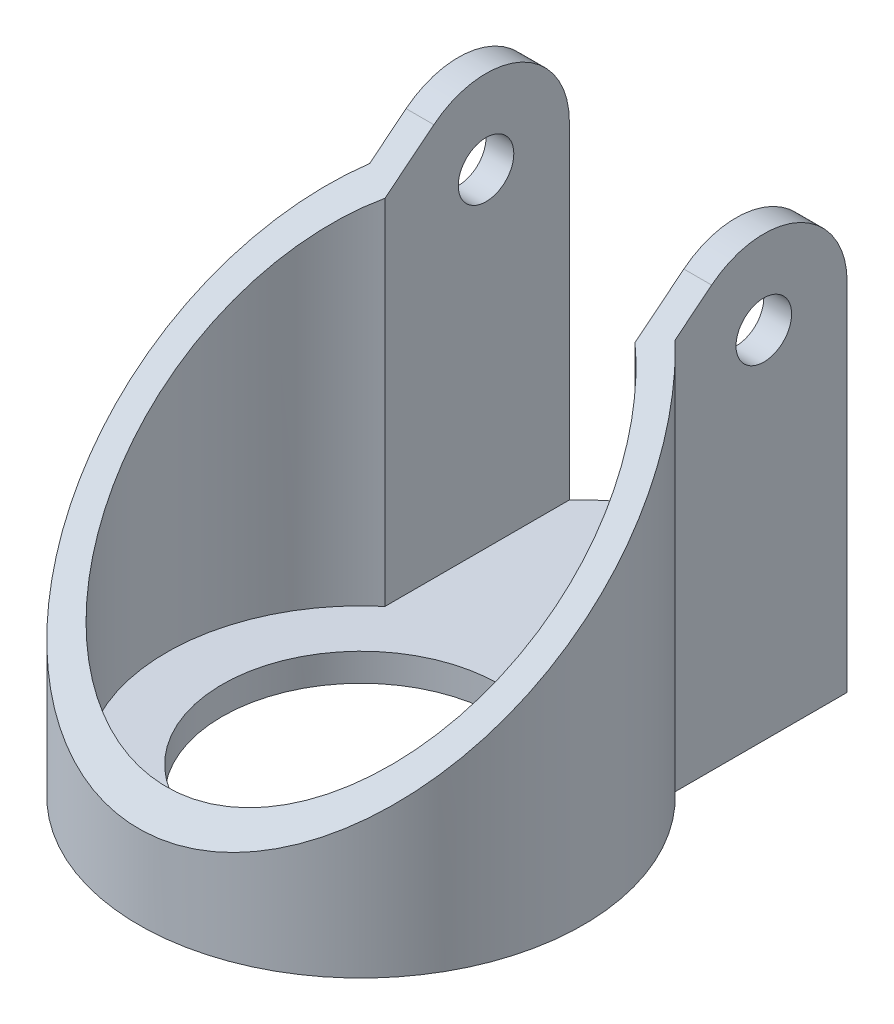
ISO-10303-21;
HEADER;
FILE_DESCRIPTION(('STEP AP214'),'2;1');
FILE_NAME('part.step','',(''),(''),'','','');
FILE_SCHEMA(('AUTOMOTIVE_DESIGN { 1 0 10303 214 1 1 1 1 }'));
ENDSEC;
DATA;
#1=APPLICATION_CONTEXT('core data for automotive mechanical design processes');
#2=APPLICATION_PROTOCOL_DEFINITION('international standard','automotive_design',2000,#1);
#3=PRODUCT_CONTEXT('',#1,'mechanical');
#4=PRODUCT('Part','Part','',(#3));
#5=PRODUCT_RELATED_PRODUCT_CATEGORY('part','',(#4));
#6=PRODUCT_DEFINITION_FORMATION('','',#4);
#7=PRODUCT_DEFINITION_CONTEXT('part definition',#1,'design');
#8=PRODUCT_DEFINITION('design','',#6,#7);
#9=PRODUCT_DEFINITION_SHAPE('','',#8);
#10=(LENGTH_UNIT() NAMED_UNIT(*) SI_UNIT(.MILLI.,.METRE.));
#11=(NAMED_UNIT(*) PLANE_ANGLE_UNIT() SI_UNIT($,.RADIAN.));
#12=(NAMED_UNIT(*) SI_UNIT($,.STERADIAN.) SOLID_ANGLE_UNIT());
#13=UNCERTAINTY_MEASURE_WITH_UNIT(LENGTH_MEASURE(1.E-05),#10,'distance_accuracy_value','');
#14=(GEOMETRIC_REPRESENTATION_CONTEXT(3) GLOBAL_UNCERTAINTY_ASSIGNED_CONTEXT((#13)) GLOBAL_UNIT_ASSIGNED_CONTEXT((#10,
#11,#12)) REPRESENTATION_CONTEXT('',''));
#15=CARTESIAN_POINT('',(0.,0.,0.));
#16=DIRECTION('',(0.,0.,1.));
#17=DIRECTION('',(1.,0.,0.));
#18=AXIS2_PLACEMENT_3D('',#15,#16,#17);
#19=CARTESIAN_POINT('',(-27.4999999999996,100.,-60.0000000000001));
#20=DIRECTION('',(0.,0.,1.00000000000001));
#21=DIRECTION('',(1.00000000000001,0.,0.));
#22=AXIS2_PLACEMENT_3D('',#19,#20,#21);
#23=PLANE('',#22);
#24=DIRECTION('',(0.,-1.,0.));
#25=VECTOR('',#24,1.);
#26=CARTESIAN_POINT('',(22.4999999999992,99.9999999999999,-60.0000000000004));
#27=LINE('',#26,#25);
#28=CARTESIAN_POINT('',(22.4999999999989,4.99999999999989,-60.0000000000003));
#29=VERTEX_POINT('',#28);
#30=CARTESIAN_POINT('',(22.4999999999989,-1.11022302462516E-13,-60.0000000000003));
#31=VERTEX_POINT('',#30);
#32=EDGE_CURVE('E245',#29,#31,#27,.T.);
#33=ORIENTED_EDGE('',*,*,#32,.F.);
#34=DIRECTION('',(0.,1.,0.));
#35=VECTOR('',#34,1.);
#36=CARTESIAN_POINT('',(22.4999999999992,99.9999999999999,-60.0000000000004));
#37=LINE('',#36,#35);
#38=CARTESIAN_POINT('',(22.4999999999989,63.9999999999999,-60.0000000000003));
#39=VERTEX_POINT('',#38);
#40=EDGE_CURVE('E168',#29,#39,#37,.T.);
#41=ORIENTED_EDGE('',*,*,#40,.T.);
#42=DIRECTION('',(1.00000000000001,0.,0.));
#43=VECTOR('',#42,1.);
#44=CARTESIAN_POINT('',(-49.9999999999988,63.9999999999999,-60.0000000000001));
#45=LINE('',#44,#43);
#46=CARTESIAN_POINT('',(27.5000000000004,63.9999999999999,-60.0000000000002));
#47=VERTEX_POINT('',#46);
#48=EDGE_CURVE('E179',#39,#47,#45,.T.);
#49=ORIENTED_EDGE('',*,*,#48,.T.);
#50=DIRECTION('',(0.,-1.,0.));
#51=VECTOR('',#50,1.);
#52=CARTESIAN_POINT('',(27.5000000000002,99.9999999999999,-60.));
#53=LINE('',#52,#51);
#54=CARTESIAN_POINT('',(27.5000000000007,-1.11022302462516E-13,-60.0000000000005));
#55=VERTEX_POINT('',#54);
#56=EDGE_CURVE('E248',#47,#55,#53,.T.);
#57=ORIENTED_EDGE('',*,*,#56,.T.);
#58=DIRECTION('',(-1.00000000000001,0.,0.));
#59=VECTOR('',#58,1.);
#60=CARTESIAN_POINT('',(22.4999999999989,-1.11022302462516E-13,-60.0000000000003));
#61=LINE('',#60,#59);
#62=EDGE_CURVE('E220',#55,#31,#61,.T.);
#63=ORIENTED_EDGE('',*,*,#62,.T.);
#64=EDGE_LOOP('',(#33,#41,#49,#57,#63));
#65=FACE_BOUND('',#64,.T.);
#66=ADVANCED_FACE('F39',(#65),#23,.F.);
#67=CARTESIAN_POINT('',(-49.9999999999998,63.9999999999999,-45.));
#68=DIRECTION('',(1.00000000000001,0.,0.));
#69=DIRECTION('',(0.,0.,-1.00000000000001));
#70=AXIS2_PLACEMENT_3D('',#67,#68,#69);
#71=CYLINDRICAL_SURFACE('',#70,5.);
#72=CARTESIAN_POINT('',(22.5000000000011,63.9999999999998,-44.9999999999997));
#73=DIRECTION('',(1.00000000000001,0.,0.));
#74=DIRECTION('',(0.,0.,-1.00000000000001));
#75=AXIS2_PLACEMENT_3D('',#72,#73,#74);
#76=CIRCLE('',#75,5.);
#77=CARTESIAN_POINT('',(22.5000000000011,63.9999999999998,-49.9999999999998));
#78=VERTEX_POINT('',#77);
#79=EDGE_CURVE('E172',#78,#78,#76,.F.);
#80=ORIENTED_EDGE('',*,*,#79,.T.);
#81=EDGE_LOOP('',(#80));
#82=FACE_BOUND('',#81,.T.);
#83=CARTESIAN_POINT('',(27.4999999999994,63.9999999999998,-44.9999999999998));
#84=DIRECTION('',(-1.00000000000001,0.,0.));
#85=DIRECTION('',(0.,0.,1.00000000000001));
#86=AXIS2_PLACEMENT_3D('',#83,#84,#85);
#87=CIRCLE('',#86,5.);
#88=CARTESIAN_POINT('',(27.4999999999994,63.9999999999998,-39.9999999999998));
#89=VERTEX_POINT('',#88);
#90=EDGE_CURVE('E205',#89,#89,#87,.T.);
#91=ORIENTED_EDGE('',*,*,#90,.F.);
#92=EDGE_LOOP('',(#91));
#93=FACE_BOUND('',#92,.T.);
#94=ADVANCED_FACE('F312',(#82,#93),#71,.F.);
#95=CARTESIAN_POINT('',(-49.9999999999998,63.9999999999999,-45.));
#96=DIRECTION('',(1.00000000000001,0.,0.));
#97=DIRECTION('',(0.,0.,-1.00000000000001));
#98=AXIS2_PLACEMENT_3D('',#95,#96,#97);
#99=CYLINDRICAL_SURFACE('',#98,15.);
#100=CARTESIAN_POINT('',(22.5000000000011,63.9999999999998,-44.9999999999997));
#101=DIRECTION('',(1.00000000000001,0.,0.));
#102=DIRECTION('',(0.,0.,-1.00000000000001));
#103=AXIS2_PLACEMENT_3D('',#100,#101,#102);
#104=CIRCLE('',#103,15.);
#105=CARTESIAN_POINT('',(22.5000000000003,75.697217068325,-35.6098395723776));
#106=VERTEX_POINT('',#105);
#107=EDGE_CURVE('E165',#106,#39,#104,.F.);
#108=ORIENTED_EDGE('',*,*,#107,.F.);
#109=DIRECTION('',(1.00000000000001,0.,0.));
#110=VECTOR('',#109,1.);
#111=CARTESIAN_POINT('',(-50.0000000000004,75.697217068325,-35.6098395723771));
#112=LINE('',#111,#110);
#113=CARTESIAN_POINT('',(27.4999999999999,75.697217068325,-35.6098395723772));
#114=VERTEX_POINT('',#113);
#115=EDGE_CURVE('E185',#106,#114,#112,.T.);
#116=ORIENTED_EDGE('',*,*,#115,.T.);
#117=CARTESIAN_POINT('',(27.4999999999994,63.9999999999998,-44.9999999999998));
#118=DIRECTION('',(-1.00000000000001,0.,0.));
#119=DIRECTION('',(0.,0.,1.00000000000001));
#120=AXIS2_PLACEMENT_3D('',#117,#118,#119);
#121=CIRCLE('',#120,15.);
#122=EDGE_CURVE('E198',#114,#47,#121,.T.);
#123=ORIENTED_EDGE('',*,*,#122,.T.);
#124=ORIENTED_EDGE('',*,*,#48,.F.);
#125=EDGE_LOOP('',(#108,#116,#123,#124));
#126=FACE_BOUND('',#125,.T.);
#127=ADVANCED_FACE('F280',(#126),#99,.T.);
#128=CARTESIAN_POINT('',(0.,100.,2.35922392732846E-13));
#129=DIRECTION('',(0.,-1.,0.));
#130=DIRECTION('',(0.,0.,-1.00000000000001));
#131=AXIS2_PLACEMENT_3D('',#128,#129,#130);
#132=CYLINDRICAL_SURFACE('',#131,40.);
#133=CARTESIAN_POINT('',(-9.43689570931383E-13,47.1107503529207,0.));
#134=DIRECTION('',(0.,0.779814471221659,0.626010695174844));
#135=DIRECTION('',(0.,-0.626010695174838,0.779814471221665));
#136=AXIS2_PLACEMENT_3D('',#133,#134,#135);
#137=ELLIPSE('',#136,51.2942519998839,40.);
#138=CARTESIAN_POINT('',(-27.4999999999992,70.4290756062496,-29.0473750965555));
#139=VERTEX_POINT('',#138);
#140=CARTESIAN_POINT('',(27.499999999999,70.4290756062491,-29.0473750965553));
#141=VERTEX_POINT('',#140);
#142=EDGE_CURVE('E191',#139,#141,#137,.T.);
#143=ORIENTED_EDGE('',*,*,#142,.F.);
#144=DIRECTION('',(0.,-1.,0.));
#145=VECTOR('',#144,1.);
#146=CARTESIAN_POINT('',(-27.4999999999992,100.,-29.0473750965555));
#147=LINE('',#146,#145);
#148=CARTESIAN_POINT('',(-27.4999999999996,0.,-29.0473750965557));
#149=VERTEX_POINT('',#148);
#150=EDGE_CURVE('E235',#139,#149,#147,.T.);
#151=ORIENTED_EDGE('',*,*,#150,.T.);
#152=CARTESIAN_POINT('',(0.,0.,0.));
#153=DIRECTION('',(0.,1.,0.));
#154=DIRECTION('',(0.,0.,1.00000000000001));
#155=AXIS2_PLACEMENT_3D('',#152,#153,#154);
#156=CIRCLE('',#155,40.);
#157=CARTESIAN_POINT('',(27.4999999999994,0.,-29.0473750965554));
#158=VERTEX_POINT('',#157);
#159=EDGE_CURVE('E213',#149,#158,#156,.T.);
#160=ORIENTED_EDGE('',*,*,#159,.T.);
#161=DIRECTION('',(0.,-1.,0.));
#162=VECTOR('',#161,1.);
#163=CARTESIAN_POINT('',(27.4999999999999,100.,-29.0473750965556));
#164=LINE('',#163,#162);
#165=EDGE_CURVE('E251',#141,#158,#164,.T.);
#166=ORIENTED_EDGE('',*,*,#165,.F.);
#167=EDGE_LOOP('',(#143,#151,#160,#166));
#168=FACE_BOUND('',#167,.T.);
#169=ADVANCED_FACE('F41',(#168),#132,.T.);
#170=CARTESIAN_POINT('',(27.5000000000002,99.9999999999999,-60.));
#171=DIRECTION('',(-1.00000000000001,0.,0.));
#172=DIRECTION('',(0.,0.,1.00000000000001));
#173=AXIS2_PLACEMENT_3D('',#170,#171,#172);
#174=PLANE('',#173);
#175=ORIENTED_EDGE('',*,*,#90,.T.);
#176=EDGE_LOOP('',(#175));
#177=FACE_BOUND('',#176,.T.);
#178=DIRECTION('',(0.,0.626010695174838,-0.779814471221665));
#179=VECTOR('',#178,1.);
#180=CARTESIAN_POINT('',(27.4999999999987,97.1278181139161,-62.3056978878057));
#181=LINE('',#180,#179);
#182=EDGE_CURVE('E194',#141,#114,#181,.T.);
#183=ORIENTED_EDGE('',*,*,#182,.F.);
#184=ORIENTED_EDGE('',*,*,#165,.T.);
#185=DIRECTION('',(0.,0.,-1.00000000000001));
#186=VECTOR('',#185,1.);
#187=CARTESIAN_POINT('',(27.5000000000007,-1.11022302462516E-13,-60.0000000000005));
#188=LINE('',#187,#186);
#189=EDGE_CURVE('E216',#158,#55,#188,.T.);
#190=ORIENTED_EDGE('',*,*,#189,.T.);
#191=ORIENTED_EDGE('',*,*,#56,.F.);
#192=ORIENTED_EDGE('',*,*,#122,.F.);
#193=EDGE_LOOP('',(#183,#184,#190,#191,#192));
#194=FACE_BOUND('',#193,.T.);
#195=ADVANCED_FACE('F282',(#177,#194),#174,.F.);
#196=CARTESIAN_POINT('',(0.,100.,-39.6875000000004));
#197=DIRECTION('',(0.,-1.,0.));
#198=DIRECTION('',(0.,0.,-1.00000000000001));
#199=AXIS2_PLACEMENT_3D('',#196,#197,#198);
#200=CYLINDRICAL_SURFACE('',#199,30.3125);
#201=DIRECTION('',(0.,-1.,0.));
#202=VECTOR('',#201,1.);
#203=CARTESIAN_POINT('',(-22.5000000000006,100.,-60.0000000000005));
#204=LINE('',#203,#202);
#205=CARTESIAN_POINT('',(-22.5,4.99999999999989,-60.0000000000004));
#206=VERTEX_POINT('',#205);
#207=CARTESIAN_POINT('',(-22.5,-1.11022302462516E-13,-60.0000000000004));
#208=VERTEX_POINT('',#207);
#209=EDGE_CURVE('E241',#206,#208,#204,.T.);
#210=ORIENTED_EDGE('',*,*,#209,.F.);
#211=CARTESIAN_POINT('',(2.22044604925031E-13,4.99999999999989,-39.6875000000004));
#212=DIRECTION('',(0.,1.,0.));
#213=DIRECTION('',(0.,0.,1.00000000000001));
#214=AXIS2_PLACEMENT_3D('',#211,#212,#213);
#215=CIRCLE('',#214,30.3125);
#216=EDGE_CURVE('E142',#29,#206,#215,.T.);
#217=ORIENTED_EDGE('',*,*,#216,.F.);
#218=ORIENTED_EDGE('',*,*,#32,.T.);
#219=CARTESIAN_POINT('',(2.22044604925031E-13,-1.11022302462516E-13,-39.6875000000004));
#220=DIRECTION('',(0.,1.,0.));
#221=DIRECTION('',(0.,0.,-1.00000000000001));
#222=AXIS2_PLACEMENT_3D('',#219,#220,#221);
#223=CIRCLE('',#222,30.3125);
#224=EDGE_CURVE('E224',#31,#208,#223,.T.);
#225=ORIENTED_EDGE('',*,*,#224,.T.);
#226=EDGE_LOOP('',(#210,#217,#218,#225));
#227=FACE_BOUND('',#226,.T.);
#228=ADVANCED_FACE('F294',(#227),#200,.T.);
#229=CARTESIAN_POINT('',(-27.4999999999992,100.,-29.0473750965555));
#230=DIRECTION('',(1.00000000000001,0.,0.));
#231=DIRECTION('',(0.,0.,-1.00000000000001));
#232=AXIS2_PLACEMENT_3D('',#229,#230,#231);
#233=PLANE('',#232);
#234=CARTESIAN_POINT('',(-27.5000000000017,63.9999999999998,-45.));
#235=DIRECTION('',(1.00000000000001,0.,0.));
#236=DIRECTION('',(0.,0.,-1.00000000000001));
#237=AXIS2_PLACEMENT_3D('',#234,#235,#236);
#238=CIRCLE('',#237,5.);
#239=CARTESIAN_POINT('',(-27.5000000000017,63.9999999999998,-50.0000000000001));
#240=VERTEX_POINT('',#239);
#241=EDGE_CURVE('E204',#240,#240,#238,.T.);
#242=ORIENTED_EDGE('',*,*,#241,.T.);
#243=EDGE_LOOP('',(#242));
#244=FACE_BOUND('',#243,.T.);
#245=DIRECTION('',(0.,-0.626010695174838,0.779814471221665));
#246=VECTOR('',#245,1.);
#247=CARTESIAN_POINT('',(-27.499999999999,82.0176071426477,-43.4830782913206));
#248=LINE('',#247,#246);
#249=CARTESIAN_POINT('',(-27.500000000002,75.697217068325,-35.6098395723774));
#250=VERTEX_POINT('',#249);
#251=EDGE_CURVE('E184',#250,#139,#248,.T.);
#252=ORIENTED_EDGE('',*,*,#251,.F.);
#253=CARTESIAN_POINT('',(-27.5000000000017,63.9999999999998,-45.));
#254=DIRECTION('',(1.00000000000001,0.,0.));
#255=DIRECTION('',(0.,0.,-1.00000000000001));
#256=AXIS2_PLACEMENT_3D('',#253,#254,#255);
#257=CIRCLE('',#256,15.);
#258=CARTESIAN_POINT('',(-27.4999999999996,63.9999999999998,-60.0000000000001));
#259=VERTEX_POINT('',#258);
#260=EDGE_CURVE('E255',#259,#250,#257,.T.);
#261=ORIENTED_EDGE('',*,*,#260,.F.);
#262=DIRECTION('',(0.,-1.,0.));
#263=VECTOR('',#262,1.);
#264=CARTESIAN_POINT('',(-27.4999999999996,100.,-60.0000000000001));
#265=LINE('',#264,#263);
#266=CARTESIAN_POINT('',(-27.5000000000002,-1.11022302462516E-13,-60.));
#267=VERTEX_POINT('',#266);
#268=EDGE_CURVE('E238',#259,#267,#265,.T.);
#269=ORIENTED_EDGE('',*,*,#268,.T.);
#270=DIRECTION('',(0.,0.,1.00000000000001));
#271=VECTOR('',#270,1.);
#272=CARTESIAN_POINT('',(-27.4999999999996,0.,-29.0473750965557));
#273=LINE('',#272,#271);
#274=EDGE_CURVE('E231',#267,#149,#273,.T.);
#275=ORIENTED_EDGE('',*,*,#274,.T.);
#276=ORIENTED_EDGE('',*,*,#150,.F.);
#277=EDGE_LOOP('',(#252,#261,#269,#275,#276));
#278=FACE_BOUND('',#277,.T.);
#279=ADVANCED_FACE('F302',(#244,#278),#233,.F.);
#280=CARTESIAN_POINT('',(0.,100.,2.35922392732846E-13));
#281=DIRECTION('',(0.,-1.,0.));
#282=DIRECTION('',(0.,0.,-1.00000000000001));
#283=AXIS2_PLACEMENT_3D('',#280,#281,#282);
#284=CYLINDRICAL_SURFACE('',#283,25.);
#285=CARTESIAN_POINT('',(-9.43689570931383E-13,5.,0.));
#286=DIRECTION('',(0.,-1.,0.));
#287=DIRECTION('',(0.,0.,-1.00000000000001));
#288=AXIS2_PLACEMENT_3D('',#285,#286,#287);
#289=CIRCLE('',#288,25.);
#290=CARTESIAN_POINT('',(-9.45077349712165E-13,5.,-25.0000000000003));
#291=VERTEX_POINT('',#290);
#292=EDGE_CURVE('E175',#291,#291,#289,.T.);
#293=ORIENTED_EDGE('',*,*,#292,.F.);
#294=EDGE_LOOP('',(#293));
#295=FACE_BOUND('',#294,.T.);
#296=CARTESIAN_POINT('',(0.,0.,0.));
#297=DIRECTION('',(0.,1.,0.));
#298=DIRECTION('',(0.,0.,1.00000000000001));
#299=AXIS2_PLACEMENT_3D('',#296,#297,#298);
#300=CIRCLE('',#299,25.);
#301=CARTESIAN_POINT('',(0.,0.,25.0000000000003));
#302=VERTEX_POINT('',#301);
#303=EDGE_CURVE('E209',#302,#302,#300,.T.);
#304=ORIENTED_EDGE('',*,*,#303,.F.);
#305=EDGE_LOOP('',(#304));
#306=FACE_BOUND('',#305,.T.);
#307=ADVANCED_FACE('F330',(#295,#306),#284,.F.);
#308=CARTESIAN_POINT('',(0.,0.,0.));
#309=DIRECTION('',(0.,1.,0.));
#310=DIRECTION('',(0.,0.,1.00000000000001));
#311=AXIS2_PLACEMENT_3D('',#308,#309,#310);
#312=PLANE('',#311);
#313=ORIENTED_EDGE('',*,*,#159,.F.);
#314=ORIENTED_EDGE('',*,*,#274,.F.);
#315=DIRECTION('',(-1.00000000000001,0.,0.));
#316=VECTOR('',#315,1.);
#317=CARTESIAN_POINT('',(-27.5000000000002,-1.11022302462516E-13,-60.));
#318=LINE('',#317,#316);
#319=EDGE_CURVE('E227',#208,#267,#318,.T.);
#320=ORIENTED_EDGE('',*,*,#319,.F.);
#321=ORIENTED_EDGE('',*,*,#224,.F.);
#322=ORIENTED_EDGE('',*,*,#62,.F.);
#323=ORIENTED_EDGE('',*,*,#189,.F.);
#324=EDGE_LOOP('',(#313,#314,#320,#321,#322,#323));
#325=FACE_BOUND('',#324,.T.);
#326=ORIENTED_EDGE('',*,*,#303,.T.);
#327=EDGE_LOOP('',(#326));
#328=FACE_BOUND('',#327,.T.);
#329=ADVANCED_FACE('F289',(#325,#328),#312,.F.);
#330=CARTESIAN_POINT('',(-22.5000000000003,63.9999999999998,-60.0000000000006));
#331=VERTEX_POINT('',#330);
#332=EDGE_CURVE('E62',#259,#331,#45,.T.);
#333=ORIENTED_EDGE('',*,*,#332,.T.);
#334=DIRECTION('',(0.,-1.,0.));
#335=VECTOR('',#334,1.);
#336=CARTESIAN_POINT('',(-22.5000000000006,100.,-60.0000000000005));
#337=LINE('',#336,#335);
#338=EDGE_CURVE('E159',#331,#206,#337,.T.);
#339=ORIENTED_EDGE('',*,*,#338,.T.);
#340=ORIENTED_EDGE('',*,*,#209,.T.);
#341=ORIENTED_EDGE('',*,*,#319,.T.);
#342=ORIENTED_EDGE('',*,*,#268,.F.);
#343=EDGE_LOOP('',(#333,#339,#340,#341,#342));
#344=FACE_BOUND('',#343,.T.);
#345=ADVANCED_FACE('F296',(#344),#23,.F.);
#346=CARTESIAN_POINT('',(-22.5000000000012,63.9999999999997,-45.));
#347=DIRECTION('',(-1.00000000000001,0.,0.));
#348=DIRECTION('',(0.,0.,1.00000000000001));
#349=AXIS2_PLACEMENT_3D('',#346,#347,#348);
#350=CIRCLE('',#349,5.);
#351=CARTESIAN_POINT('',(-22.5000000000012,63.9999999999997,-40.));
#352=VERTEX_POINT('',#351);
#353=EDGE_CURVE('E161',#352,#352,#350,.F.);
#354=ORIENTED_EDGE('',*,*,#353,.T.);
#355=EDGE_LOOP('',(#354));
#356=FACE_BOUND('',#355,.T.);
#357=ORIENTED_EDGE('',*,*,#241,.F.);
#358=EDGE_LOOP('',(#357));
#359=FACE_BOUND('',#358,.T.);
#360=ADVANCED_FACE('F321',(#356,#359),#71,.F.);
#361=CARTESIAN_POINT('',(-49.9999999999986,4.99999999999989,-60.0000000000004));
#362=DIRECTION('',(0.,1.,0.));
#363=DIRECTION('',(0.,0.,1.00000000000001));
#364=AXIS2_PLACEMENT_3D('',#361,#362,#363);
#365=PLANE('',#364);
#366=ORIENTED_EDGE('',*,*,#216,.T.);
#367=DIRECTION('',(0.,0.,-1.00000000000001));
#368=VECTOR('',#367,1.);
#369=CARTESIAN_POINT('',(-22.5,4.99999999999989,-65.0000000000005));
#370=LINE('',#369,#368);
#371=CARTESIAN_POINT('',(-22.5000000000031,5.,-26.8095132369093));
#372=VERTEX_POINT('',#371);
#373=EDGE_CURVE('E125',#372,#206,#370,.T.);
#374=ORIENTED_EDGE('',*,*,#373,.F.);
#375=CARTESIAN_POINT('',(-9.43689570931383E-13,5.,0.));
#376=DIRECTION('',(0.,-1.,0.));
#377=DIRECTION('',(0.,0.,-1.00000000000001));
#378=AXIS2_PLACEMENT_3D('',#375,#376,#377);
#379=CIRCLE('',#378,35.);
#380=CARTESIAN_POINT('',(22.4999999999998,5.00000000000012,-26.8095132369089));
#381=VERTEX_POINT('',#380);
#382=EDGE_CURVE('E140',#381,#372,#379,.T.);
#383=ORIENTED_EDGE('',*,*,#382,.F.);
#384=DIRECTION('',(0.,0.,1.00000000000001));
#385=VECTOR('',#384,1.);
#386=CARTESIAN_POINT('',(22.4999999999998,5.00000000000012,-26.8095132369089));
#387=LINE('',#386,#385);
#388=EDGE_CURVE('E133',#29,#381,#387,.T.);
#389=ORIENTED_EDGE('',*,*,#388,.F.);
#390=EDGE_LOOP('',(#366,#374,#383,#389));
#391=FACE_BOUND('',#390,.T.);
#392=ORIENTED_EDGE('',*,*,#292,.T.);
#393=EDGE_LOOP('',(#392));
#394=FACE_BOUND('',#393,.T.);
#395=ADVANCED_FACE('F137',(#391,#394),#365,.T.);
#396=CARTESIAN_POINT('',(-22.5000000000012,63.9999999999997,-45.));
#397=DIRECTION('',(-1.00000000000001,0.,0.));
#398=DIRECTION('',(0.,0.,1.00000000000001));
#399=AXIS2_PLACEMENT_3D('',#396,#397,#398);
#400=CIRCLE('',#399,15.);
#401=CARTESIAN_POINT('',(-22.5,75.697217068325,-35.6098395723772));
#402=VERTEX_POINT('',#401);
#403=EDGE_CURVE('E55',#331,#402,#400,.F.);
#404=ORIENTED_EDGE('',*,*,#403,.F.);
#405=ORIENTED_EDGE('',*,*,#332,.F.);
#406=ORIENTED_EDGE('',*,*,#260,.T.);
#407=EDGE_CURVE('E180',#250,#402,#112,.T.);
#408=ORIENTED_EDGE('',*,*,#407,.T.);
#409=EDGE_LOOP('',(#404,#405,#406,#408));
#410=FACE_BOUND('',#409,.T.);
#411=ADVANCED_FACE('F304',(#410),#99,.T.);
#412=CARTESIAN_POINT('',(-49.9999999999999,14.9999999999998,40.0000000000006));
#413=DIRECTION('',(0.,0.779814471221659,0.626010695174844));
#414=DIRECTION('',(0.,-0.626010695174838,0.779814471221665));
#415=AXIS2_PLACEMENT_3D('',#412,#413,#414);
#416=PLANE('',#415);
#417=DIRECTION('',(0.,0.626010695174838,-0.779814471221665));
#418=VECTOR('',#417,1.);
#419=CARTESIAN_POINT('',(22.5000000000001,14.9999999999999,40.0000000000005));
#420=LINE('',#419,#418);
#421=CARTESIAN_POINT('',(22.5000000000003,68.6325900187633,-26.8095132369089));
#422=VERTEX_POINT('',#421);
#423=EDGE_CURVE('E12',#422,#106,#420,.T.);
#424=ORIENTED_EDGE('',*,*,#423,.F.);
#425=CARTESIAN_POINT('',(-9.43689570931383E-13,47.1107503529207,0.));
#426=DIRECTION('',(0.,0.779814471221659,0.626010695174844));
#427=DIRECTION('',(0.,-0.626010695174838,0.779814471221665));
#428=AXIS2_PLACEMENT_3D('',#425,#426,#427);
#429=ELLIPSE('',#428,44.8824704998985,35.);
#430=CARTESIAN_POINT('',(-22.5000000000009,68.6325900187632,-26.8095132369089));
#431=VERTEX_POINT('',#430);
#432=EDGE_CURVE('E48',#431,#422,#429,.T.);
#433=ORIENTED_EDGE('',*,*,#432,.F.);
#434=DIRECTION('',(0.,-0.626010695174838,0.779814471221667));
#435=VECTOR('',#434,1.);
#436=CARTESIAN_POINT('',(-22.5000000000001,14.9999999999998,40.0000000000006));
#437=LINE('',#436,#435);
#438=EDGE_CURVE('E127',#402,#431,#437,.T.);
#439=ORIENTED_EDGE('',*,*,#438,.F.);
#440=ORIENTED_EDGE('',*,*,#407,.F.);
#441=ORIENTED_EDGE('',*,*,#251,.T.);
#442=ORIENTED_EDGE('',*,*,#142,.T.);
#443=ORIENTED_EDGE('',*,*,#182,.T.);
#444=ORIENTED_EDGE('',*,*,#115,.F.);
#445=EDGE_LOOP('',(#424,#433,#439,#440,#441,#442,#443,#444));
#446=FACE_BOUND('',#445,.T.);
#447=ADVANCED_FACE('F270',(#446),#416,.T.);
#448=CARTESIAN_POINT('',(22.5,105.,-26.8095132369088));
#449=DIRECTION('',(1.00000000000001,0.,0.));
#450=DIRECTION('',(0.,0.,-1.00000000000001));
#451=AXIS2_PLACEMENT_3D('',#448,#449,#450);
#452=PLANE('',#451);
#453=ORIENTED_EDGE('',*,*,#388,.T.);
#454=DIRECTION('',(0.,-1.,0.));
#455=VECTOR('',#454,1.);
#456=CARTESIAN_POINT('',(22.5,105.,-26.8095132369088));
#457=LINE('',#456,#455);
#458=EDGE_CURVE('E132',#422,#381,#457,.T.);
#459=ORIENTED_EDGE('',*,*,#458,.F.);
#460=ORIENTED_EDGE('',*,*,#423,.T.);
#461=ORIENTED_EDGE('',*,*,#107,.T.);
#462=ORIENTED_EDGE('',*,*,#40,.F.);
#463=EDGE_LOOP('',(#453,#459,#460,#461,#462));
#464=FACE_BOUND('',#463,.T.);
#465=ORIENTED_EDGE('',*,*,#79,.F.);
#466=EDGE_LOOP('',(#465));
#467=FACE_BOUND('',#466,.T.);
#468=ADVANCED_FACE('F266',(#464,#467),#452,.F.);
#469=CARTESIAN_POINT('',(-22.5,105.,-65.0000000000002));
#470=DIRECTION('',(-1.00000000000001,0.,0.));
#471=DIRECTION('',(0.,0.,1.00000000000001));
#472=AXIS2_PLACEMENT_3D('',#469,#470,#471);
#473=PLANE('',#472);
#474=ORIENTED_EDGE('',*,*,#403,.T.);
#475=ORIENTED_EDGE('',*,*,#438,.T.);
#476=DIRECTION('',(0.,-1.,0.));
#477=VECTOR('',#476,1.);
#478=CARTESIAN_POINT('',(-22.5000000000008,105.,-26.8095132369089));
#479=LINE('',#478,#477);
#480=EDGE_CURVE('E121',#431,#372,#479,.T.);
#481=ORIENTED_EDGE('',*,*,#480,.T.);
#482=ORIENTED_EDGE('',*,*,#373,.T.);
#483=ORIENTED_EDGE('',*,*,#338,.F.);
#484=EDGE_LOOP('',(#474,#475,#481,#482,#483));
#485=FACE_BOUND('',#484,.T.);
#486=ORIENTED_EDGE('',*,*,#353,.F.);
#487=EDGE_LOOP('',(#486));
#488=FACE_BOUND('',#487,.T.);
#489=ADVANCED_FACE('F123',(#485,#488),#473,.F.);
#490=CARTESIAN_POINT('',(0.,105.,2.35922392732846E-13));
#491=DIRECTION('',(0.,-1.,0.));
#492=DIRECTION('',(0.,0.,-1.00000000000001));
#493=AXIS2_PLACEMENT_3D('',#490,#491,#492);
#494=CYLINDRICAL_SURFACE('',#493,35.);
#495=ORIENTED_EDGE('',*,*,#432,.T.);
#496=ORIENTED_EDGE('',*,*,#458,.T.);
#497=ORIENTED_EDGE('',*,*,#382,.T.);
#498=ORIENTED_EDGE('',*,*,#480,.F.);
#499=EDGE_LOOP('',(#495,#496,#497,#498));
#500=FACE_BOUND('',#499,.T.);
#501=ADVANCED_FACE('F145',(#500),#494,.F.);
#502=CLOSED_SHELL('',(#66,#94,#127,#169,#195,#228,#279,#307,#329,#345,#360,#395,#411,#447,#468,
#489,#501));
#503=MANIFOLD_SOLID_BREP('B2',#502);
#504=ADVANCED_BREP_SHAPE_REPRESENTATION('',(#18,#503),#14);
#505=SHAPE_DEFINITION_REPRESENTATION(#9,#504);
ENDSEC;
END-ISO-10303-21;
